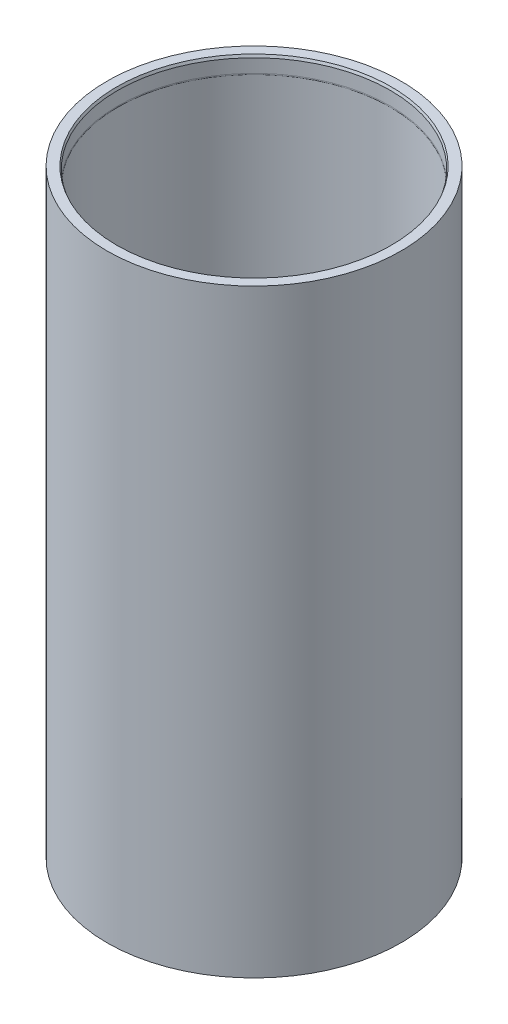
ISO-10303-21;
HEADER;
FILE_DESCRIPTION(('STEP AP214'),'2;1');
FILE_NAME('part.step','',(''),(''),'','','');
FILE_SCHEMA(('AUTOMOTIVE_DESIGN { 1 0 10303 214 1 1 1 1 }'));
ENDSEC;
DATA;
#1=APPLICATION_CONTEXT('core data for automotive mechanical design processes');
#2=APPLICATION_PROTOCOL_DEFINITION('international standard','automotive_design',2000,#1);
#3=PRODUCT_CONTEXT('',#1,'mechanical');
#4=PRODUCT('Part','Part','',(#3));
#5=PRODUCT_RELATED_PRODUCT_CATEGORY('part','',(#4));
#6=PRODUCT_DEFINITION_FORMATION('','',#4);
#7=PRODUCT_DEFINITION_CONTEXT('part definition',#1,'design');
#8=PRODUCT_DEFINITION('design','',#6,#7);
#9=PRODUCT_DEFINITION_SHAPE('','',#8);
#10=(LENGTH_UNIT() NAMED_UNIT(*) SI_UNIT(.MILLI.,.METRE.));
#11=(NAMED_UNIT(*) PLANE_ANGLE_UNIT() SI_UNIT($,.RADIAN.));
#12=(NAMED_UNIT(*) SI_UNIT($,.STERADIAN.) SOLID_ANGLE_UNIT());
#13=UNCERTAINTY_MEASURE_WITH_UNIT(LENGTH_MEASURE(1.E-05),#10,'distance_accuracy_value','');
#14=(GEOMETRIC_REPRESENTATION_CONTEXT(3) GLOBAL_UNCERTAINTY_ASSIGNED_CONTEXT((#13)) GLOBAL_UNIT_ASSIGNED_CONTEXT((#10,
#11,#12)) REPRESENTATION_CONTEXT('',''));
#15=CARTESIAN_POINT('',(0.,0.,0.));
#16=DIRECTION('',(0.,0.,1.));
#17=DIRECTION('',(1.,0.,0.));
#18=AXIS2_PLACEMENT_3D('',#15,#16,#17);
#19=CARTESIAN_POINT('',(0.,279.4,0.));
#20=DIRECTION('',(0.,-1.,0.));
#21=DIRECTION('',(0.,0.,-1.));
#22=AXIS2_PLACEMENT_3D('',#19,#20,#21);
#23=CYLINDRICAL_SURFACE('',#22,127.);
#24=CARTESIAN_POINT('',(0.,-263.525,0.));
#25=DIRECTION('',(0.,-1.,0.));
#26=DIRECTION('',(0.,0.,-1.));
#27=AXIS2_PLACEMENT_3D('',#24,#25,#26);
#28=CIRCLE('',#27,127.);
#29=CARTESIAN_POINT('',(0.,-263.525,-127.));
#30=VERTEX_POINT('',#29);
#31=EDGE_CURVE('E73',#30,#30,#28,.T.);
#32=ORIENTED_EDGE('',*,*,#31,.T.);
#33=EDGE_LOOP('',(#32));
#34=FACE_BOUND('',#33,.T.);
#35=CARTESIAN_POINT('',(0.,263.525,0.));
#36=DIRECTION('',(0.,1.,0.));
#37=DIRECTION('',(0.,0.,1.));
#38=AXIS2_PLACEMENT_3D('',#35,#36,#37);
#39=CIRCLE('',#38,127.);
#40=CARTESIAN_POINT('',(0.,263.525,127.));
#41=VERTEX_POINT('',#40);
#42=EDGE_CURVE('E70',#41,#41,#39,.T.);
#43=ORIENTED_EDGE('',*,*,#42,.T.);
#44=EDGE_LOOP('',(#43));
#45=FACE_BOUND('',#44,.T.);
#46=ADVANCED_FACE('F39',(#34,#45),#23,.F.);
#47=CARTESIAN_POINT('',(0.,279.4,0.));
#48=DIRECTION('',(0.,1.,0.));
#49=DIRECTION('',(0.,0.,1.));
#50=AXIS2_PLACEMENT_3D('',#47,#48,#49);
#51=PLANE('',#50);
#52=CARTESIAN_POINT('',(0.,279.4,0.));
#53=DIRECTION('',(0.,1.,0.));
#54=DIRECTION('',(0.,0.,1.));
#55=AXIS2_PLACEMENT_3D('',#52,#53,#54);
#56=CIRCLE('',#55,128.016);
#57=CARTESIAN_POINT('',(0.,279.4,128.016));
#58=VERTEX_POINT('',#57);
#59=EDGE_CURVE('E58',#58,#58,#56,.F.);
#60=ORIENTED_EDGE('',*,*,#59,.T.);
#61=EDGE_LOOP('',(#60));
#62=FACE_BOUND('',#61,.T.);
#63=CARTESIAN_POINT('',(0.,279.4,0.));
#64=DIRECTION('',(0.,1.,0.));
#65=DIRECTION('',(0.,0.,1.));
#66=AXIS2_PLACEMENT_3D('',#63,#64,#65);
#67=CIRCLE('',#66,137.16);
#68=CARTESIAN_POINT('',(0.,279.4,137.16));
#69=VERTEX_POINT('',#68);
#70=EDGE_CURVE('E69',#69,#69,#67,.T.);
#71=ORIENTED_EDGE('',*,*,#70,.T.);
#72=EDGE_LOOP('',(#71));
#73=FACE_BOUND('',#72,.T.);
#74=ADVANCED_FACE('F83',(#62,#73),#51,.T.);
#75=CARTESIAN_POINT('',(0.,-279.4,0.));
#76=DIRECTION('',(0.,1.,0.));
#77=DIRECTION('',(0.,0.,1.));
#78=AXIS2_PLACEMENT_3D('',#75,#76,#77);
#79=PLANE('',#78);
#80=CARTESIAN_POINT('',(0.,-279.4,0.));
#81=DIRECTION('',(0.,1.,0.));
#82=DIRECTION('',(0.,0.,1.));
#83=AXIS2_PLACEMENT_3D('',#80,#81,#82);
#84=CIRCLE('',#83,128.016);
#85=CARTESIAN_POINT('',(0.,-279.4,128.016));
#86=VERTEX_POINT('',#85);
#87=EDGE_CURVE('E10',#86,#86,#84,.T.);
#88=ORIENTED_EDGE('',*,*,#87,.T.);
#89=EDGE_LOOP('',(#88));
#90=FACE_BOUND('',#89,.T.);
#91=CARTESIAN_POINT('',(0.,-279.4,0.));
#92=DIRECTION('',(0.,1.,0.));
#93=DIRECTION('',(0.,0.,1.));
#94=AXIS2_PLACEMENT_3D('',#91,#92,#93);
#95=CIRCLE('',#94,137.16);
#96=CARTESIAN_POINT('',(0.,-279.4,137.16));
#97=VERTEX_POINT('',#96);
#98=EDGE_CURVE('E77',#97,#97,#95,.T.);
#99=ORIENTED_EDGE('',*,*,#98,.F.);
#100=EDGE_LOOP('',(#99));
#101=FACE_BOUND('',#100,.T.);
#102=ADVANCED_FACE('F89',(#90,#101),#79,.F.);
#103=CARTESIAN_POINT('',(0.,279.4,0.));
#104=DIRECTION('',(0.,-1.,0.));
#105=DIRECTION('',(0.,0.,-1.));
#106=AXIS2_PLACEMENT_3D('',#103,#104,#105);
#107=CYLINDRICAL_SURFACE('',#106,137.16);
#108=ORIENTED_EDGE('',*,*,#70,.F.);
#109=EDGE_LOOP('',(#108));
#110=FACE_BOUND('',#109,.T.);
#111=ORIENTED_EDGE('',*,*,#98,.T.);
#112=EDGE_LOOP('',(#111));
#113=FACE_BOUND('',#112,.T.);
#114=ADVANCED_FACE('F85',(#110,#113),#107,.T.);
#115=CARTESIAN_POINT('',(0.,-263.525,0.));
#116=DIRECTION('',(0.,-1.,0.));
#117=DIRECTION('',(0.,0.,-1.));
#118=AXIS2_PLACEMENT_3D('',#115,#116,#117);
#119=CYLINDRICAL_SURFACE('',#118,127.127);
#120=CARTESIAN_POINT('',(0.,-276.957492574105,0.));
#121=DIRECTION('',(0.,1.,0.));
#122=DIRECTION('',(0.,0.,1.));
#123=AXIS2_PLACEMENT_3D('',#120,#121,#122);
#124=CIRCLE('',#123,127.127);
#125=CARTESIAN_POINT('',(0.,-276.957492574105,127.127));
#126=VERTEX_POINT('',#125);
#127=EDGE_CURVE('E47',#126,#126,#124,.F.);
#128=ORIENTED_EDGE('',*,*,#127,.T.);
#129=EDGE_LOOP('',(#128));
#130=FACE_BOUND('',#129,.T.);
#131=CARTESIAN_POINT('',(0.,-264.318114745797,0.));
#132=DIRECTION('',(0.,1.,0.));
#133=DIRECTION('',(0.,0.,1.));
#134=AXIS2_PLACEMENT_3D('',#131,#132,#133);
#135=CIRCLE('',#134,127.127);
#136=CARTESIAN_POINT('',(0.,-264.318114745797,127.127));
#137=VERTEX_POINT('',#136);
#138=EDGE_CURVE('E63',#137,#137,#135,.T.);
#139=ORIENTED_EDGE('',*,*,#138,.T.);
#140=EDGE_LOOP('',(#139));
#141=FACE_BOUND('',#140,.T.);
#142=ADVANCED_FACE('F88',(#130,#141),#119,.F.);
#143=CARTESIAN_POINT('',(0.,263.525,0.));
#144=DIRECTION('',(0.,1.,0.));
#145=DIRECTION('',(0.,0.,1.));
#146=AXIS2_PLACEMENT_3D('',#143,#144,#145);
#147=CYLINDRICAL_SURFACE('',#146,127.127);
#148=CARTESIAN_POINT('',(0.,276.957492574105,0.));
#149=DIRECTION('',(0.,1.,0.));
#150=DIRECTION('',(0.,0.,1.));
#151=AXIS2_PLACEMENT_3D('',#148,#149,#150);
#152=CIRCLE('',#151,127.127);
#153=CARTESIAN_POINT('',(0.,276.957492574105,127.127));
#154=VERTEX_POINT('',#153);
#155=EDGE_CURVE('E53',#154,#154,#152,.T.);
#156=ORIENTED_EDGE('',*,*,#155,.T.);
#157=EDGE_LOOP('',(#156));
#158=FACE_BOUND('',#157,.T.);
#159=CARTESIAN_POINT('',(0.,264.318114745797,0.));
#160=DIRECTION('',(0.,-1.,0.));
#161=DIRECTION('',(0.,0.,-1.));
#162=AXIS2_PLACEMENT_3D('',#159,#160,#161);
#163=CIRCLE('',#162,127.127);
#164=CARTESIAN_POINT('',(0.,264.318114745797,-127.127));
#165=VERTEX_POINT('',#164);
#166=EDGE_CURVE('E66',#165,#165,#163,.T.);
#167=ORIENTED_EDGE('',*,*,#166,.T.);
#168=EDGE_LOOP('',(#167));
#169=FACE_BOUND('',#168,.T.);
#170=ADVANCED_FACE('F109',(#158,#169),#147,.F.);
#171=CARTESIAN_POINT('',(0.,264.318114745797,0.));
#172=DIRECTION('',(0.,-1.,0.));
#173=DIRECTION('',(0.,0.,-1.));
#174=AXIS2_PLACEMENT_3D('',#171,#172,#173);
#175=TOROIDAL_SURFACE('',#174,124.587,2.54);
#176=ORIENTED_EDGE('',*,*,#42,.F.);
#177=EDGE_LOOP('',(#176));
#178=FACE_BOUND('',#177,.T.);
#179=ORIENTED_EDGE('',*,*,#166,.F.);
#180=EDGE_LOOP('',(#179));
#181=FACE_BOUND('',#180,.T.);
#182=ADVANCED_FACE('F111',(#178,#181),#175,.F.);
#183=CARTESIAN_POINT('',(0.,-264.318114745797,0.));
#184=DIRECTION('',(0.,1.,0.));
#185=DIRECTION('',(0.,0.,1.));
#186=AXIS2_PLACEMENT_3D('',#183,#184,#185);
#187=TOROIDAL_SURFACE('',#186,124.587,2.54);
#188=ORIENTED_EDGE('',*,*,#138,.F.);
#189=EDGE_LOOP('',(#188));
#190=FACE_BOUND('',#189,.T.);
#191=ORIENTED_EDGE('',*,*,#31,.F.);
#192=EDGE_LOOP('',(#191));
#193=FACE_BOUND('',#192,.T.);
#194=ADVANCED_FACE('F116',(#190,#193),#187,.F.);
#195=CARTESIAN_POINT('',(0.,279.4,0.));
#196=DIRECTION('',(0.,1.,0.));
#197=DIRECTION('',(0.,0.,1.));
#198=AXIS2_PLACEMENT_3D('',#195,#196,#197);
#199=CONICAL_SURFACE('',#198,128.016,0.349065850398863);
#200=ORIENTED_EDGE('',*,*,#155,.F.);
#201=EDGE_LOOP('',(#200));
#202=FACE_BOUND('',#201,.T.);
#203=ORIENTED_EDGE('',*,*,#59,.F.);
#204=EDGE_LOOP('',(#203));
#205=FACE_BOUND('',#204,.T.);
#206=ADVANCED_FACE('F124',(#202,#205),#199,.F.);
#207=CARTESIAN_POINT('',(0.,-276.957492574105,0.));
#208=DIRECTION('',(0.,-1.,0.));
#209=DIRECTION('',(0.,0.,-1.));
#210=AXIS2_PLACEMENT_3D('',#207,#208,#209);
#211=CONICAL_SURFACE('',#210,127.127,0.349065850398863);
#212=ORIENTED_EDGE('',*,*,#87,.F.);
#213=EDGE_LOOP('',(#212));
#214=FACE_BOUND('',#213,.T.);
#215=ORIENTED_EDGE('',*,*,#127,.F.);
#216=EDGE_LOOP('',(#215));
#217=FACE_BOUND('',#216,.T.);
#218=ADVANCED_FACE('F41',(#214,#217),#211,.F.);
#219=CLOSED_SHELL('',(#46,#74,#102,#114,#142,#170,#182,#194,#206,#218));
#220=MANIFOLD_SOLID_BREP('B2',#219);
#221=ADVANCED_BREP_SHAPE_REPRESENTATION('',(#18,#220),#14);
#222=SHAPE_DEFINITION_REPRESENTATION(#9,#221);
ENDSEC;
END-ISO-10303-21;
